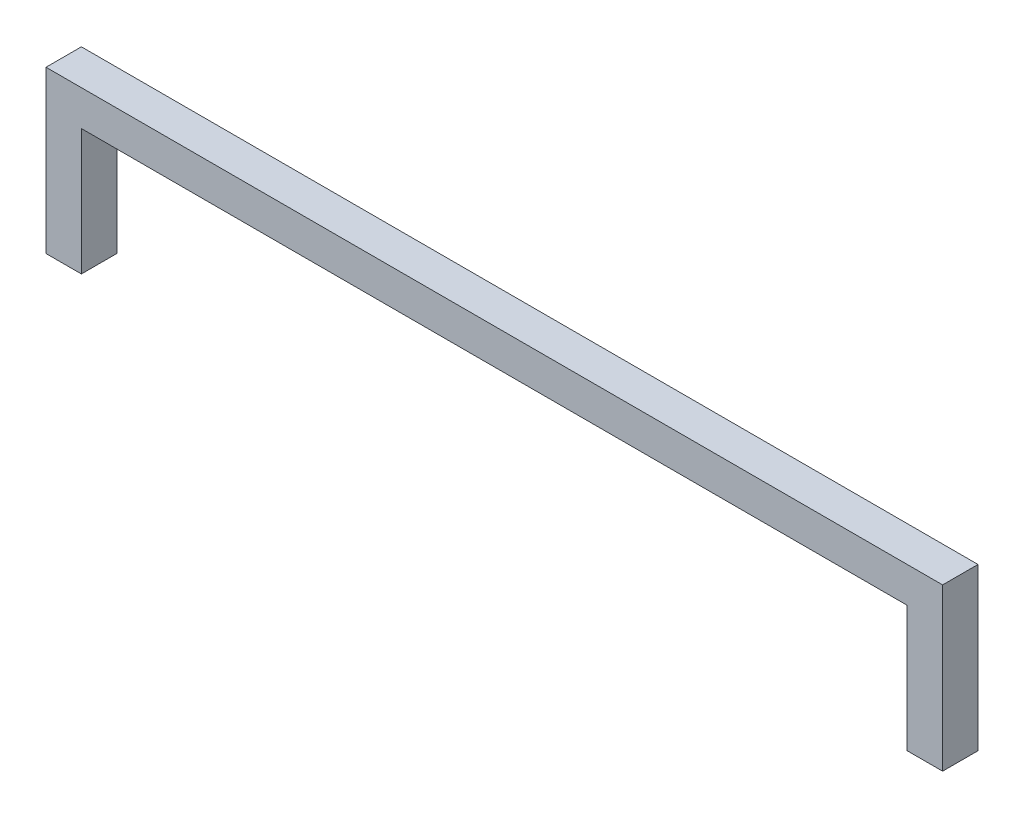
from build123d import *

# Parameters (mm, degrees)
SCHIZZO2_W   = 30
SCHIZZO2_H   = 30
SCHIZZO2_W_2 = 28
SCHIZZO2_H_2 = 28


with BuildPart() as part:
    # Sweep-Sottile1: sweep along a path in Schizzo1
    with BuildLine(Plane.XY) as sweep_sottile1_path:
        Line((0, 0), (0, 106.77))
        Line((0, 106.77), (700, 106.77))
        Line((700, 106.77), (700, 0))
    # Schizzo2 → Sweep-Sottile1 (sweep)
    with BuildSketch(Plane(origin=(0, 0, 0), x_dir=(1, 0, 0), z_dir=(0, 1, 0))):
        with Locations((-15, -15)):
            Rectangle(SCHIZZO2_W, SCHIZZO2_H)
        with Locations((-15, -15)):
            Rectangle(SCHIZZO2_W_2, SCHIZZO2_H_2, mode=Mode.SUBTRACT)
    sweep(path=sweep_sottile1_path.line, transition=Transition.RIGHT)


solid = part.part
